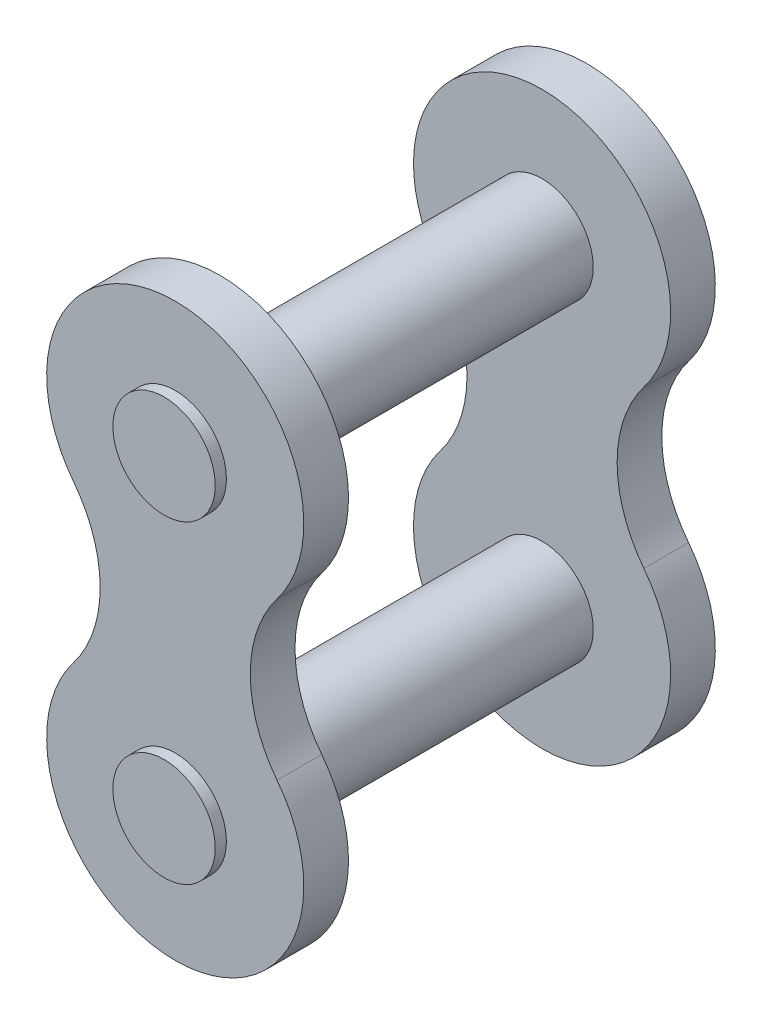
ISO-10303-21;
HEADER;
FILE_DESCRIPTION(('STEP AP214'),'2;1');
FILE_NAME('part.step','',(''),(''),'','','');
FILE_SCHEMA(('AUTOMOTIVE_DESIGN { 1 0 10303 214 1 1 1 1 }'));
ENDSEC;
DATA;
#1=APPLICATION_CONTEXT('core data for automotive mechanical design processes');
#2=APPLICATION_PROTOCOL_DEFINITION('international standard','automotive_design',2000,#1);
#3=PRODUCT_CONTEXT('',#1,'mechanical');
#4=PRODUCT('Part','Part','',(#3));
#5=PRODUCT_RELATED_PRODUCT_CATEGORY('part','',(#4));
#6=PRODUCT_DEFINITION_FORMATION('','',#4);
#7=PRODUCT_DEFINITION_CONTEXT('part definition',#1,'design');
#8=PRODUCT_DEFINITION('design','',#6,#7);
#9=PRODUCT_DEFINITION_SHAPE('','',#8);
#10=(LENGTH_UNIT() NAMED_UNIT(*) SI_UNIT(.MILLI.,.METRE.));
#11=(NAMED_UNIT(*) PLANE_ANGLE_UNIT() SI_UNIT($,.RADIAN.));
#12=(NAMED_UNIT(*) SI_UNIT($,.STERADIAN.) SOLID_ANGLE_UNIT());
#13=UNCERTAINTY_MEASURE_WITH_UNIT(LENGTH_MEASURE(1.E-05),#10,'distance_accuracy_value','');
#14=(GEOMETRIC_REPRESENTATION_CONTEXT(3) GLOBAL_UNCERTAINTY_ASSIGNED_CONTEXT((#13)) GLOBAL_UNIT_ASSIGNED_CONTEXT((#10,
#11,#12)) REPRESENTATION_CONTEXT('',''));
#15=CARTESIAN_POINT('',(0.,0.,0.));
#16=DIRECTION('',(0.,0.,1.));
#17=DIRECTION('',(1.,0.,0.));
#18=AXIS2_PLACEMENT_3D('',#15,#16,#17);
#19=CARTESIAN_POINT('',(0.,0.,-13.03));
#20=DIRECTION('',(0.,0.,1.));
#21=DIRECTION('',(1.,0.,0.));
#22=AXIS2_PLACEMENT_3D('',#19,#20,#21);
#23=PLANE('',#22);
#24=CARTESIAN_POINT('',(0.,25.4,-13.03));
#25=DIRECTION('',(0.,0.,1.));
#26=DIRECTION('',(1.,0.,0.));
#27=AXIS2_PLACEMENT_3D('',#24,#25,#26);
#28=CIRCLE('',#27,4.14);
#29=CARTESIAN_POINT('',(4.14,25.4,-13.03));
#30=VERTEX_POINT('',#29);
#31=EDGE_CURVE('E138',#30,#30,#28,.T.);
#32=ORIENTED_EDGE('',*,*,#31,.F.);
#33=EDGE_LOOP('',(#32));
#34=FACE_BOUND('',#33,.T.);
#35=CARTESIAN_POINT('',(0.,0.,-13.03));
#36=DIRECTION('',(0.,0.,1.));
#37=DIRECTION('',(1.,0.,0.));
#38=AXIS2_PLACEMENT_3D('',#35,#36,#37);
#39=CIRCLE('',#38,4.14);
#40=CARTESIAN_POINT('',(4.14,0.,-13.03));
#41=VERTEX_POINT('',#40);
#42=EDGE_CURVE('E152',#41,#41,#39,.T.);
#43=ORIENTED_EDGE('',*,*,#42,.F.);
#44=EDGE_LOOP('',(#43));
#45=FACE_BOUND('',#44,.T.);
#46=CARTESIAN_POINT('',(-16.4727046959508,12.7,-13.03));
#47=DIRECTION('',(0.,0.,-1.));
#48=DIRECTION('',(0.,1.,0.));
#49=AXIS2_PLACEMENT_3D('',#46,#47,#48);
#50=CIRCLE('',#49,10.4);
#51=CARTESIAN_POINT('',(-8.23635234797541,19.05,-13.03));
#52=VERTEX_POINT('',#51);
#53=CARTESIAN_POINT('',(-8.23635234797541,6.35,-13.03));
#54=VERTEX_POINT('',#53);
#55=EDGE_CURVE('E33',#52,#54,#50,.T.);
#56=ORIENTED_EDGE('',*,*,#55,.T.);
#57=CARTESIAN_POINT('',(0.,0.,-13.03));
#58=DIRECTION('',(0.,0.,-1.));
#59=DIRECTION('',(0.,1.,0.));
#60=AXIS2_PLACEMENT_3D('',#57,#58,#59);
#61=CIRCLE('',#60,10.4);
#62=CARTESIAN_POINT('',(8.23635234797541,6.35,-13.03));
#63=VERTEX_POINT('',#62);
#64=EDGE_CURVE('E183',#63,#54,#61,.T.);
#65=ORIENTED_EDGE('',*,*,#64,.F.);
#66=CARTESIAN_POINT('',(16.4727046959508,12.7,-13.03));
#67=DIRECTION('',(0.,0.,-1.));
#68=DIRECTION('',(0.,1.,0.));
#69=AXIS2_PLACEMENT_3D('',#66,#67,#68);
#70=CIRCLE('',#69,10.4);
#71=CARTESIAN_POINT('',(8.2363523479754,19.05,-13.03));
#72=VERTEX_POINT('',#71);
#73=EDGE_CURVE('E164',#63,#72,#70,.T.);
#74=ORIENTED_EDGE('',*,*,#73,.T.);
#75=CARTESIAN_POINT('',(0.,25.4,-13.03));
#76=DIRECTION('',(0.,0.,-1.));
#77=DIRECTION('',(0.,1.,0.));
#78=AXIS2_PLACEMENT_3D('',#75,#76,#77);
#79=CIRCLE('',#78,10.4);
#80=EDGE_CURVE('E172',#52,#72,#79,.T.);
#81=ORIENTED_EDGE('',*,*,#80,.F.);
#82=EDGE_LOOP('',(#56,#65,#74,#81));
#83=FACE_BOUND('',#82,.T.);
#84=ADVANCED_FACE('F15',(#34,#45,#83),#23,.T.);
#85=CARTESIAN_POINT('',(0.,0.,-16.646));
#86=DIRECTION('',(0.,0.,-1.));
#87=DIRECTION('',(-1.,0.,0.));
#88=AXIS2_PLACEMENT_3D('',#85,#86,#87);
#89=PLANE('',#88);
#90=CARTESIAN_POINT('',(0.,25.4,-16.646));
#91=DIRECTION('',(0.,0.,-1.));
#92=DIRECTION('',(-1.,0.,0.));
#93=AXIS2_PLACEMENT_3D('',#90,#91,#92);
#94=CIRCLE('',#93,4.14);
#95=CARTESIAN_POINT('',(-4.14,25.4,-16.646));
#96=VERTEX_POINT('',#95);
#97=EDGE_CURVE('E143',#96,#96,#94,.T.);
#98=ORIENTED_EDGE('',*,*,#97,.F.);
#99=EDGE_LOOP('',(#98));
#100=FACE_BOUND('',#99,.T.);
#101=CARTESIAN_POINT('',(0.,0.,-16.646));
#102=DIRECTION('',(0.,0.,-1.));
#103=DIRECTION('',(-1.,0.,0.));
#104=AXIS2_PLACEMENT_3D('',#101,#102,#103);
#105=CIRCLE('',#104,4.14);
#106=CARTESIAN_POINT('',(-4.14,0.,-16.646));
#107=VERTEX_POINT('',#106);
#108=EDGE_CURVE('E156',#107,#107,#105,.T.);
#109=ORIENTED_EDGE('',*,*,#108,.F.);
#110=EDGE_LOOP('',(#109));
#111=FACE_BOUND('',#110,.T.);
#112=CARTESIAN_POINT('',(-16.4727046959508,12.7,-16.646));
#113=DIRECTION('',(0.,0.,1.));
#114=DIRECTION('',(0.,1.,0.));
#115=AXIS2_PLACEMENT_3D('',#112,#113,#114);
#116=CIRCLE('',#115,10.4);
#117=CARTESIAN_POINT('',(-8.23635234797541,6.35,-16.646));
#118=VERTEX_POINT('',#117);
#119=CARTESIAN_POINT('',(-8.23635234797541,19.05,-16.646));
#120=VERTEX_POINT('',#119);
#121=EDGE_CURVE('E151',#118,#120,#116,.T.);
#122=ORIENTED_EDGE('',*,*,#121,.T.);
#123=CARTESIAN_POINT('',(0.,25.4,-16.646));
#124=DIRECTION('',(0.,0.,1.));
#125=DIRECTION('',(0.,1.,0.));
#126=AXIS2_PLACEMENT_3D('',#123,#124,#125);
#127=CIRCLE('',#126,10.4);
#128=CARTESIAN_POINT('',(8.23635234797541,19.05,-16.646));
#129=VERTEX_POINT('',#128);
#130=EDGE_CURVE('E168',#129,#120,#127,.T.);
#131=ORIENTED_EDGE('',*,*,#130,.F.);
#132=CARTESIAN_POINT('',(16.4727046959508,12.7,-16.646));
#133=DIRECTION('',(0.,0.,1.));
#134=DIRECTION('',(0.,1.,0.));
#135=AXIS2_PLACEMENT_3D('',#132,#133,#134);
#136=CIRCLE('',#135,10.4);
#137=CARTESIAN_POINT('',(8.23635234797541,6.35,-16.646));
#138=VERTEX_POINT('',#137);
#139=EDGE_CURVE('E41',#129,#138,#136,.T.);
#140=ORIENTED_EDGE('',*,*,#139,.T.);
#141=CARTESIAN_POINT('',(0.,0.,-16.646));
#142=DIRECTION('',(0.,0.,1.));
#143=DIRECTION('',(0.,1.,0.));
#144=AXIS2_PLACEMENT_3D('',#141,#142,#143);
#145=CIRCLE('',#144,10.4);
#146=EDGE_CURVE('E179',#118,#138,#145,.T.);
#147=ORIENTED_EDGE('',*,*,#146,.F.);
#148=EDGE_LOOP('',(#122,#131,#140,#147));
#149=FACE_BOUND('',#148,.T.);
#150=ADVANCED_FACE('F234',(#100,#111,#149),#89,.T.);
#151=CARTESIAN_POINT('',(0.,0.,-16.646));
#152=DIRECTION('',(0.,0.,1.));
#153=DIRECTION('',(0.,1.,0.));
#154=AXIS2_PLACEMENT_3D('',#151,#152,#153);
#155=CYLINDRICAL_SURFACE('',#154,10.4);
#156=DIRECTION('',(0.,0.,1.));
#157=VECTOR('',#156,1.);
#158=CARTESIAN_POINT('',(-8.23635234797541,6.35,-16.646));
#159=LINE('',#158,#157);
#160=EDGE_CURVE('E190',#118,#54,#159,.T.);
#161=ORIENTED_EDGE('',*,*,#160,.F.);
#162=ORIENTED_EDGE('',*,*,#146,.T.);
#163=DIRECTION('',(0.,0.,1.));
#164=VECTOR('',#163,1.);
#165=CARTESIAN_POINT('',(8.23635234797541,6.35,-16.646));
#166=LINE('',#165,#164);
#167=EDGE_CURVE('E187',#63,#138,#166,.F.);
#168=ORIENTED_EDGE('',*,*,#167,.F.);
#169=ORIENTED_EDGE('',*,*,#64,.T.);
#170=EDGE_LOOP('',(#161,#162,#168,#169));
#171=FACE_BOUND('',#170,.T.);
#172=ADVANCED_FACE('F17',(#171),#155,.T.);
#173=CARTESIAN_POINT('',(0.,25.4,-16.646));
#174=DIRECTION('',(0.,0.,1.));
#175=DIRECTION('',(0.,1.,0.));
#176=AXIS2_PLACEMENT_3D('',#173,#174,#175);
#177=CYLINDRICAL_SURFACE('',#176,10.4);
#178=ORIENTED_EDGE('',*,*,#130,.T.);
#179=DIRECTION('',(0.,0.,1.));
#180=VECTOR('',#179,1.);
#181=CARTESIAN_POINT('',(-8.23635234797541,19.05,-16.646));
#182=LINE('',#181,#180);
#183=EDGE_CURVE('E176',#120,#52,#182,.T.);
#184=ORIENTED_EDGE('',*,*,#183,.T.);
#185=ORIENTED_EDGE('',*,*,#80,.T.);
#186=DIRECTION('',(0.,0.,1.));
#187=VECTOR('',#186,1.);
#188=CARTESIAN_POINT('',(8.23635234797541,19.05,-16.646));
#189=LINE('',#188,#187);
#190=EDGE_CURVE('E193',#72,#129,#189,.F.);
#191=ORIENTED_EDGE('',*,*,#190,.T.);
#192=EDGE_LOOP('',(#178,#184,#185,#191));
#193=FACE_BOUND('',#192,.T.);
#194=ADVANCED_FACE('F245',(#193),#177,.T.);
#195=CARTESIAN_POINT('',(16.4727046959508,12.7,-16.646));
#196=DIRECTION('',(0.,0.,1.));
#197=DIRECTION('',(0.,1.,0.));
#198=AXIS2_PLACEMENT_3D('',#195,#196,#197);
#199=CYLINDRICAL_SURFACE('',#198,10.4);
#200=ORIENTED_EDGE('',*,*,#167,.T.);
#201=ORIENTED_EDGE('',*,*,#139,.F.);
#202=ORIENTED_EDGE('',*,*,#190,.F.);
#203=ORIENTED_EDGE('',*,*,#73,.F.);
#204=EDGE_LOOP('',(#200,#201,#202,#203));
#205=FACE_BOUND('',#204,.T.);
#206=ADVANCED_FACE('F248',(#205),#199,.F.);
#207=CARTESIAN_POINT('',(-16.4727046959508,12.7,-16.646));
#208=DIRECTION('',(0.,0.,1.));
#209=DIRECTION('',(0.,1.,0.));
#210=AXIS2_PLACEMENT_3D('',#207,#208,#209);
#211=CYLINDRICAL_SURFACE('',#210,10.4);
#212=ORIENTED_EDGE('',*,*,#160,.T.);
#213=ORIENTED_EDGE('',*,*,#55,.F.);
#214=ORIENTED_EDGE('',*,*,#183,.F.);
#215=ORIENTED_EDGE('',*,*,#121,.F.);
#216=EDGE_LOOP('',(#212,#213,#214,#215));
#217=FACE_BOUND('',#216,.T.);
#218=ADVANCED_FACE('F252',(#217),#211,.F.);
#219=CARTESIAN_POINT('',(0.,0.,-17.55));
#220=DIRECTION('',(0.,0.,-1.));
#221=DIRECTION('',(-1.,0.,0.));
#222=AXIS2_PLACEMENT_3D('',#219,#220,#221);
#223=PLANE('',#222);
#224=CARTESIAN_POINT('',(0.,0.,-17.55));
#225=DIRECTION('',(0.,0.,1.));
#226=DIRECTION('',(0.,1.,0.));
#227=AXIS2_PLACEMENT_3D('',#224,#225,#226);
#228=CIRCLE('',#227,4.14);
#229=CARTESIAN_POINT('',(0.,4.14,-17.55));
#230=VERTEX_POINT('',#229);
#231=EDGE_CURVE('E137',#230,#230,#228,.T.);
#232=ORIENTED_EDGE('',*,*,#231,.F.);
#233=EDGE_LOOP('',(#232));
#234=FACE_BOUND('',#233,.T.);
#235=ADVANCED_FACE('F255',(#234),#223,.T.);
#236=CARTESIAN_POINT('',(0.,0.,-17.55));
#237=DIRECTION('',(0.,0.,1.));
#238=DIRECTION('',(0.,1.,0.));
#239=AXIS2_PLACEMENT_3D('',#236,#237,#238);
#240=CYLINDRICAL_SURFACE('',#239,4.14);
#241=ORIENTED_EDGE('',*,*,#108,.T.);
#242=EDGE_LOOP('',(#241));
#243=FACE_BOUND('',#242,.T.);
#244=ORIENTED_EDGE('',*,*,#231,.T.);
#245=EDGE_LOOP('',(#244));
#246=FACE_BOUND('',#245,.T.);
#247=ADVANCED_FACE('F256',(#243,#246),#240,.T.);
#248=CARTESIAN_POINT('',(0.,0.,13.03));
#249=DIRECTION('',(0.,0.,-1.));
#250=DIRECTION('',(-1.,0.,0.));
#251=AXIS2_PLACEMENT_3D('',#248,#249,#250);
#252=CIRCLE('',#251,4.14);
#253=CARTESIAN_POINT('',(-4.14,0.,13.03));
#254=VERTEX_POINT('',#253);
#255=EDGE_CURVE('E25',#254,#254,#252,.F.);
#256=ORIENTED_EDGE('',*,*,#255,.F.);
#257=EDGE_LOOP('',(#256));
#258=FACE_BOUND('',#257,.T.);
#259=ORIENTED_EDGE('',*,*,#42,.T.);
#260=EDGE_LOOP('',(#259));
#261=FACE_BOUND('',#260,.T.);
#262=ADVANCED_FACE('F259',(#258,#261),#240,.T.);
#263=CARTESIAN_POINT('',(0.,25.4,-17.55));
#264=DIRECTION('',(0.,0.,-1.));
#265=DIRECTION('',(-1.,0.,0.));
#266=AXIS2_PLACEMENT_3D('',#263,#264,#265);
#267=PLANE('',#266);
#268=CARTESIAN_POINT('',(0.,25.4,-17.55));
#269=DIRECTION('',(0.,0.,1.));
#270=DIRECTION('',(0.,1.,0.));
#271=AXIS2_PLACEMENT_3D('',#268,#269,#270);
#272=CIRCLE('',#271,4.14);
#273=CARTESIAN_POINT('',(0.,29.54,-17.55));
#274=VERTEX_POINT('',#273);
#275=EDGE_CURVE('E126',#274,#274,#272,.T.);
#276=ORIENTED_EDGE('',*,*,#275,.F.);
#277=EDGE_LOOP('',(#276));
#278=FACE_BOUND('',#277,.T.);
#279=ADVANCED_FACE('F268',(#278),#267,.T.);
#280=CARTESIAN_POINT('',(0.,25.4,-17.55));
#281=DIRECTION('',(0.,0.,1.));
#282=DIRECTION('',(0.,1.,0.));
#283=AXIS2_PLACEMENT_3D('',#280,#281,#282);
#284=CYLINDRICAL_SURFACE('',#283,4.14);
#285=ORIENTED_EDGE('',*,*,#97,.T.);
#286=EDGE_LOOP('',(#285));
#287=FACE_BOUND('',#286,.T.);
#288=ORIENTED_EDGE('',*,*,#275,.T.);
#289=EDGE_LOOP('',(#288));
#290=FACE_BOUND('',#289,.T.);
#291=ADVANCED_FACE('F221',(#287,#290),#284,.T.);
#292=CARTESIAN_POINT('',(0.,25.4,13.03));
#293=DIRECTION('',(0.,0.,-1.));
#294=DIRECTION('',(-1.,0.,0.));
#295=AXIS2_PLACEMENT_3D('',#292,#293,#294);
#296=CIRCLE('',#295,4.14);
#297=CARTESIAN_POINT('',(-4.14,25.4,13.03));
#298=VERTEX_POINT('',#297);
#299=EDGE_CURVE('E142',#298,#298,#296,.F.);
#300=ORIENTED_EDGE('',*,*,#299,.F.);
#301=EDGE_LOOP('',(#300));
#302=FACE_BOUND('',#301,.T.);
#303=ORIENTED_EDGE('',*,*,#31,.T.);
#304=EDGE_LOOP('',(#303));
#305=FACE_BOUND('',#304,.T.);
#306=ADVANCED_FACE('F220',(#302,#305),#284,.T.);
#307=CARTESIAN_POINT('',(0.,0.,16.646));
#308=DIRECTION('',(0.,0.,1.));
#309=DIRECTION('',(1.,0.,0.));
#310=AXIS2_PLACEMENT_3D('',#307,#308,#309);
#311=PLANE('',#310);
#312=CARTESIAN_POINT('',(0.,0.,16.646));
#313=DIRECTION('',(0.,0.,1.));
#314=DIRECTION('',(1.,0.,0.));
#315=AXIS2_PLACEMENT_3D('',#312,#313,#314);
#316=CIRCLE('',#315,4.14);
#317=CARTESIAN_POINT('',(4.14,0.,16.646));
#318=VERTEX_POINT('',#317);
#319=EDGE_CURVE('E10',#318,#318,#316,.F.);
#320=ORIENTED_EDGE('',*,*,#319,.T.);
#321=EDGE_LOOP('',(#320));
#322=FACE_BOUND('',#321,.T.);
#323=CARTESIAN_POINT('',(0.,25.4,16.646));
#324=DIRECTION('',(0.,0.,1.));
#325=DIRECTION('',(1.,0.,0.));
#326=AXIS2_PLACEMENT_3D('',#323,#324,#325);
#327=CIRCLE('',#326,4.14);
#328=CARTESIAN_POINT('',(4.14,25.4,16.646));
#329=VERTEX_POINT('',#328);
#330=EDGE_CURVE('E19',#329,#329,#327,.F.);
#331=ORIENTED_EDGE('',*,*,#330,.T.);
#332=EDGE_LOOP('',(#331));
#333=FACE_BOUND('',#332,.T.);
#334=CARTESIAN_POINT('',(-16.4727046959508,12.7,16.646));
#335=DIRECTION('',(0.,0.,-1.));
#336=DIRECTION('',(0.,1.,0.));
#337=AXIS2_PLACEMENT_3D('',#334,#335,#336);
#338=CIRCLE('',#337,10.4);
#339=CARTESIAN_POINT('',(-8.23635234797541,19.05,16.646));
#340=VERTEX_POINT('',#339);
#341=CARTESIAN_POINT('',(-8.23635234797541,6.35,16.646));
#342=VERTEX_POINT('',#341);
#343=EDGE_CURVE('E85',#340,#342,#338,.T.);
#344=ORIENTED_EDGE('',*,*,#343,.T.);
#345=CARTESIAN_POINT('',(0.,0.,16.646));
#346=DIRECTION('',(0.,0.,-1.));
#347=DIRECTION('',(0.,1.,0.));
#348=AXIS2_PLACEMENT_3D('',#345,#346,#347);
#349=CIRCLE('',#348,10.4);
#350=CARTESIAN_POINT('',(8.23635234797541,6.35,16.646));
#351=VERTEX_POINT('',#350);
#352=EDGE_CURVE('E102',#351,#342,#349,.T.);
#353=ORIENTED_EDGE('',*,*,#352,.F.);
#354=CARTESIAN_POINT('',(16.4727046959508,12.7,16.646));
#355=DIRECTION('',(0.,0.,-1.));
#356=DIRECTION('',(0.,1.,0.));
#357=AXIS2_PLACEMENT_3D('',#354,#355,#356);
#358=CIRCLE('',#357,10.4);
#359=CARTESIAN_POINT('',(8.2363523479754,19.05,16.646));
#360=VERTEX_POINT('',#359);
#361=EDGE_CURVE('E453',#351,#360,#358,.T.);
#362=ORIENTED_EDGE('',*,*,#361,.T.);
#363=CARTESIAN_POINT('',(0.,25.4,16.646));
#364=DIRECTION('',(0.,0.,-1.));
#365=DIRECTION('',(0.,1.,0.));
#366=AXIS2_PLACEMENT_3D('',#363,#364,#365);
#367=CIRCLE('',#366,10.4);
#368=EDGE_CURVE('E104',#340,#360,#367,.T.);
#369=ORIENTED_EDGE('',*,*,#368,.F.);
#370=EDGE_LOOP('',(#344,#353,#362,#369));
#371=FACE_BOUND('',#370,.T.);
#372=ADVANCED_FACE('F100',(#322,#333,#371),#311,.T.);
#373=CARTESIAN_POINT('',(0.,0.,13.03));
#374=DIRECTION('',(0.,0.,-1.));
#375=DIRECTION('',(-1.,0.,0.));
#376=AXIS2_PLACEMENT_3D('',#373,#374,#375);
#377=PLANE('',#376);
#378=ORIENTED_EDGE('',*,*,#255,.T.);
#379=EDGE_LOOP('',(#378));
#380=FACE_BOUND('',#379,.T.);
#381=ORIENTED_EDGE('',*,*,#299,.T.);
#382=EDGE_LOOP('',(#381));
#383=FACE_BOUND('',#382,.T.);
#384=CARTESIAN_POINT('',(-16.4727046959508,12.7,13.03));
#385=DIRECTION('',(0.,0.,1.));
#386=DIRECTION('',(0.,1.,0.));
#387=AXIS2_PLACEMENT_3D('',#384,#385,#386);
#388=CIRCLE('',#387,10.4);
#389=CARTESIAN_POINT('',(-8.23635234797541,6.35,13.03));
#390=VERTEX_POINT('',#389);
#391=CARTESIAN_POINT('',(-8.23635234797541,19.05,13.03));
#392=VERTEX_POINT('',#391);
#393=EDGE_CURVE('E88',#390,#392,#388,.T.);
#394=ORIENTED_EDGE('',*,*,#393,.T.);
#395=CARTESIAN_POINT('',(0.,25.4,13.03));
#396=DIRECTION('',(0.,0.,1.));
#397=DIRECTION('',(0.,1.,0.));
#398=AXIS2_PLACEMENT_3D('',#395,#396,#397);
#399=CIRCLE('',#398,10.4);
#400=CARTESIAN_POINT('',(8.23635234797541,19.05,13.03));
#401=VERTEX_POINT('',#400);
#402=EDGE_CURVE('E448',#401,#392,#399,.T.);
#403=ORIENTED_EDGE('',*,*,#402,.F.);
#404=CARTESIAN_POINT('',(16.4727046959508,12.7,13.03));
#405=DIRECTION('',(0.,0.,1.));
#406=DIRECTION('',(0.,1.,0.));
#407=AXIS2_PLACEMENT_3D('',#404,#405,#406);
#408=CIRCLE('',#407,10.4);
#409=CARTESIAN_POINT('',(8.23635234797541,6.35,13.03));
#410=VERTEX_POINT('',#409);
#411=EDGE_CURVE('E106',#401,#410,#408,.T.);
#412=ORIENTED_EDGE('',*,*,#411,.T.);
#413=CARTESIAN_POINT('',(0.,0.,13.03));
#414=DIRECTION('',(0.,0.,1.));
#415=DIRECTION('',(0.,1.,0.));
#416=AXIS2_PLACEMENT_3D('',#413,#414,#415);
#417=CIRCLE('',#416,10.4);
#418=EDGE_CURVE('E111',#390,#410,#417,.T.);
#419=ORIENTED_EDGE('',*,*,#418,.F.);
#420=EDGE_LOOP('',(#394,#403,#412,#419));
#421=FACE_BOUND('',#420,.T.);
#422=ADVANCED_FACE('F365',(#380,#383,#421),#377,.T.);
#423=CARTESIAN_POINT('',(0.,0.,13.03));
#424=DIRECTION('',(0.,0.,1.));
#425=DIRECTION('',(0.,1.,0.));
#426=AXIS2_PLACEMENT_3D('',#423,#424,#425);
#427=CYLINDRICAL_SURFACE('',#426,10.4);
#428=DIRECTION('',(0.,0.,1.));
#429=VECTOR('',#428,1.);
#430=CARTESIAN_POINT('',(-8.23635234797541,6.35,13.03));
#431=LINE('',#430,#429);
#432=EDGE_CURVE('E82',#390,#342,#431,.T.);
#433=ORIENTED_EDGE('',*,*,#432,.F.);
#434=ORIENTED_EDGE('',*,*,#418,.T.);
#435=DIRECTION('',(0.,0.,1.));
#436=VECTOR('',#435,1.);
#437=CARTESIAN_POINT('',(8.23635234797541,6.35,13.03));
#438=LINE('',#437,#436);
#439=EDGE_CURVE('E95',#351,#410,#438,.F.);
#440=ORIENTED_EDGE('',*,*,#439,.F.);
#441=ORIENTED_EDGE('',*,*,#352,.T.);
#442=EDGE_LOOP('',(#433,#434,#440,#441));
#443=FACE_BOUND('',#442,.T.);
#444=ADVANCED_FACE('F109',(#443),#427,.T.);
#445=CARTESIAN_POINT('',(0.,25.4,13.03));
#446=DIRECTION('',(0.,0.,1.));
#447=DIRECTION('',(0.,1.,0.));
#448=AXIS2_PLACEMENT_3D('',#445,#446,#447);
#449=CYLINDRICAL_SURFACE('',#448,10.4);
#450=ORIENTED_EDGE('',*,*,#402,.T.);
#451=DIRECTION('',(0.,0.,1.));
#452=VECTOR('',#451,1.);
#453=CARTESIAN_POINT('',(-8.23635234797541,19.05,13.03));
#454=LINE('',#453,#452);
#455=EDGE_CURVE('E119',#392,#340,#454,.T.);
#456=ORIENTED_EDGE('',*,*,#455,.T.);
#457=ORIENTED_EDGE('',*,*,#368,.T.);
#458=DIRECTION('',(0.,0.,1.));
#459=VECTOR('',#458,1.);
#460=CARTESIAN_POINT('',(8.23635234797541,19.05,13.03));
#461=LINE('',#460,#459);
#462=EDGE_CURVE('E94',#360,#401,#461,.F.);
#463=ORIENTED_EDGE('',*,*,#462,.T.);
#464=EDGE_LOOP('',(#450,#456,#457,#463));
#465=FACE_BOUND('',#464,.T.);
#466=ADVANCED_FACE('F386',(#465),#449,.T.);
#467=CARTESIAN_POINT('',(16.4727046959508,12.7,13.03));
#468=DIRECTION('',(0.,0.,1.));
#469=DIRECTION('',(0.,1.,0.));
#470=AXIS2_PLACEMENT_3D('',#467,#468,#469);
#471=CYLINDRICAL_SURFACE('',#470,10.4);
#472=ORIENTED_EDGE('',*,*,#439,.T.);
#473=ORIENTED_EDGE('',*,*,#411,.F.);
#474=ORIENTED_EDGE('',*,*,#462,.F.);
#475=ORIENTED_EDGE('',*,*,#361,.F.);
#476=EDGE_LOOP('',(#472,#473,#474,#475));
#477=FACE_BOUND('',#476,.T.);
#478=ADVANCED_FACE('F230',(#477),#471,.F.);
#479=CARTESIAN_POINT('',(-16.4727046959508,12.7,13.03));
#480=DIRECTION('',(0.,0.,1.));
#481=DIRECTION('',(0.,1.,0.));
#482=AXIS2_PLACEMENT_3D('',#479,#480,#481);
#483=CYLINDRICAL_SURFACE('',#482,10.4);
#484=ORIENTED_EDGE('',*,*,#432,.T.);
#485=ORIENTED_EDGE('',*,*,#343,.F.);
#486=ORIENTED_EDGE('',*,*,#455,.F.);
#487=ORIENTED_EDGE('',*,*,#393,.F.);
#488=EDGE_LOOP('',(#484,#485,#486,#487));
#489=FACE_BOUND('',#488,.T.);
#490=ADVANCED_FACE('F84',(#489),#483,.F.);
#491=CARTESIAN_POINT('',(0.,25.4,17.55));
#492=DIRECTION('',(0.,0.,1.));
#493=DIRECTION('',(1.,0.,0.));
#494=AXIS2_PLACEMENT_3D('',#491,#492,#493);
#495=PLANE('',#494);
#496=CARTESIAN_POINT('',(0.,25.4,17.55));
#497=DIRECTION('',(0.,0.,-1.));
#498=DIRECTION('',(0.,1.,0.));
#499=AXIS2_PLACEMENT_3D('',#496,#497,#498);
#500=CIRCLE('',#499,4.14);
#501=CARTESIAN_POINT('',(0.,29.54,17.55));
#502=VERTEX_POINT('',#501);
#503=EDGE_CURVE('E133',#502,#502,#500,.T.);
#504=ORIENTED_EDGE('',*,*,#503,.F.);
#505=EDGE_LOOP('',(#504));
#506=FACE_BOUND('',#505,.T.);
#507=ADVANCED_FACE('F218',(#506),#495,.T.);
#508=ORIENTED_EDGE('',*,*,#330,.F.);
#509=EDGE_LOOP('',(#508));
#510=FACE_BOUND('',#509,.T.);
#511=ORIENTED_EDGE('',*,*,#503,.T.);
#512=EDGE_LOOP('',(#511));
#513=FACE_BOUND('',#512,.T.);
#514=ADVANCED_FACE('F214',(#510,#513),#284,.T.);
#515=CARTESIAN_POINT('',(0.,0.,17.55));
#516=DIRECTION('',(0.,0.,1.));
#517=DIRECTION('',(1.,0.,0.));
#518=AXIS2_PLACEMENT_3D('',#515,#516,#517);
#519=PLANE('',#518);
#520=CARTESIAN_POINT('',(0.,0.,17.55));
#521=DIRECTION('',(0.,0.,-1.));
#522=DIRECTION('',(0.,1.,0.));
#523=AXIS2_PLACEMENT_3D('',#520,#521,#522);
#524=CIRCLE('',#523,4.14);
#525=CARTESIAN_POINT('',(0.,4.14,17.55));
#526=VERTEX_POINT('',#525);
#527=EDGE_CURVE('E147',#526,#526,#524,.T.);
#528=ORIENTED_EDGE('',*,*,#527,.F.);
#529=EDGE_LOOP('',(#528));
#530=FACE_BOUND('',#529,.T.);
#531=ADVANCED_FACE('F217',(#530),#519,.T.);
#532=ORIENTED_EDGE('',*,*,#319,.F.);
#533=EDGE_LOOP('',(#532));
#534=FACE_BOUND('',#533,.T.);
#535=ORIENTED_EDGE('',*,*,#527,.T.);
#536=EDGE_LOOP('',(#535));
#537=FACE_BOUND('',#536,.T.);
#538=ADVANCED_FACE('F261',(#534,#537),#240,.T.);
#539=CLOSED_SHELL('',(#84,#150,#172,#194,#206,#218,#235,#247,#262,#279,#291,#306,#372,#422,#444,
#466,#478,#490,#507,#514,#531,#538));
#540=MANIFOLD_SOLID_BREP('B1',#539);
#541=ADVANCED_BREP_SHAPE_REPRESENTATION('',(#18,#540),#14);
#542=SHAPE_DEFINITION_REPRESENTATION(#9,#541);
ENDSEC;
END-ISO-10303-21;
